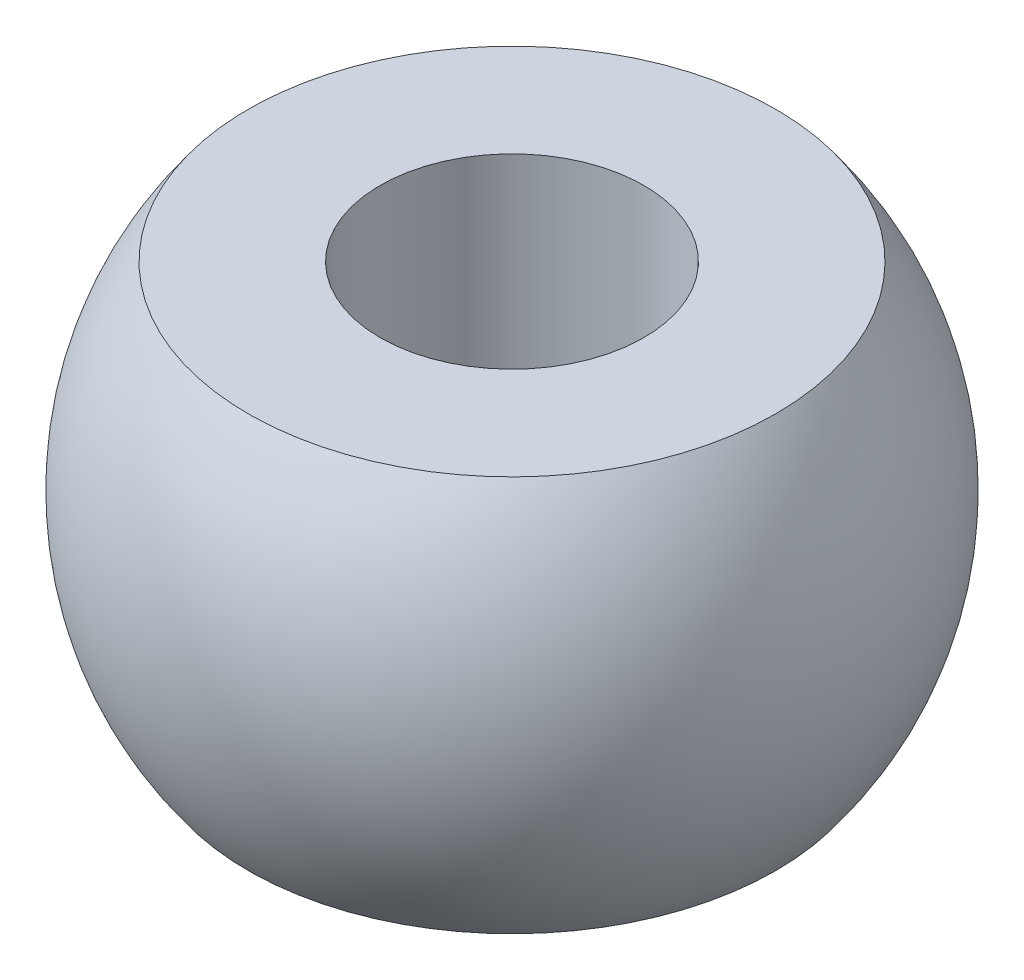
ISO-10303-21;
HEADER;
FILE_DESCRIPTION(('STEP AP214'),'2;1');
FILE_NAME('part.step','',(''),(''),'','','');
FILE_SCHEMA(('AUTOMOTIVE_DESIGN { 1 0 10303 214 1 1 1 1 }'));
ENDSEC;
DATA;
#1=APPLICATION_CONTEXT('core data for automotive mechanical design processes');
#2=APPLICATION_PROTOCOL_DEFINITION('international standard','automotive_design',2000,#1);
#3=PRODUCT_CONTEXT('',#1,'mechanical');
#4=PRODUCT('Part','Part','',(#3));
#5=PRODUCT_RELATED_PRODUCT_CATEGORY('part','',(#4));
#6=PRODUCT_DEFINITION_FORMATION('','',#4);
#7=PRODUCT_DEFINITION_CONTEXT('part definition',#1,'design');
#8=PRODUCT_DEFINITION('design','',#6,#7);
#9=PRODUCT_DEFINITION_SHAPE('','',#8);
#10=(LENGTH_UNIT() NAMED_UNIT(*) SI_UNIT(.MILLI.,.METRE.));
#11=(NAMED_UNIT(*) PLANE_ANGLE_UNIT() SI_UNIT($,.RADIAN.));
#12=(NAMED_UNIT(*) SI_UNIT($,.STERADIAN.) SOLID_ANGLE_UNIT());
#13=UNCERTAINTY_MEASURE_WITH_UNIT(LENGTH_MEASURE(1.E-05),#10,'distance_accuracy_value','');
#14=(GEOMETRIC_REPRESENTATION_CONTEXT(3) GLOBAL_UNCERTAINTY_ASSIGNED_CONTEXT((#13)) GLOBAL_UNIT_ASSIGNED_CONTEXT((#10,
#11,#12)) REPRESENTATION_CONTEXT('',''));
#15=CARTESIAN_POINT('',(0.,0.,0.));
#16=DIRECTION('',(0.,0.,1.));
#17=DIRECTION('',(1.,0.,0.));
#18=AXIS2_PLACEMENT_3D('',#15,#16,#17);
#19=CARTESIAN_POINT('',(0.,43.4669792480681,0.));
#20=DIRECTION('',(0.,1.,0.));
#21=DIRECTION('',(0.,0.,1.));
#22=AXIS2_PLACEMENT_3D('',#19,#20,#21);
#23=CYLINDRICAL_SURFACE('',#22,4.00000000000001);
#24=CARTESIAN_POINT('',(0.,-6.,0.));
#25=DIRECTION('',(0.,1.,0.));
#26=DIRECTION('',(0.,0.,1.));
#27=AXIS2_PLACEMENT_3D('',#24,#25,#26);
#28=CIRCLE('',#27,4.00000000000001);
#29=CARTESIAN_POINT('',(0.,-6.,4.00000000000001));
#30=VERTEX_POINT('',#29);
#31=EDGE_CURVE('E10',#30,#30,#28,.T.);
#32=ORIENTED_EDGE('',*,*,#31,.F.);
#33=EDGE_LOOP('',(#32));
#34=FACE_BOUND('',#33,.T.);
#35=CARTESIAN_POINT('',(0.,6.,0.));
#36=DIRECTION('',(0.,1.,0.));
#37=DIRECTION('',(0.,0.,1.));
#38=AXIS2_PLACEMENT_3D('',#35,#36,#37);
#39=CIRCLE('',#38,4.);
#40=CARTESIAN_POINT('',(0.,6.,4.));
#41=VERTEX_POINT('',#40);
#42=EDGE_CURVE('E42',#41,#41,#39,.T.);
#43=ORIENTED_EDGE('',*,*,#42,.T.);
#44=EDGE_LOOP('',(#43));
#45=FACE_BOUND('',#44,.T.);
#46=ADVANCED_FACE('F28',(#34,#45),#23,.F.);
#47=CARTESIAN_POINT('',(4.00000000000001,-6.,0.));
#48=DIRECTION('',(0.,1.,0.));
#49=DIRECTION('',(0.,0.,1.));
#50=AXIS2_PLACEMENT_3D('',#47,#48,#49);
#51=PLANE('',#50);
#52=CARTESIAN_POINT('',(0.,-6.,0.));
#53=DIRECTION('',(0.,1.,0.));
#54=DIRECTION('',(0.,0.,1.));
#55=AXIS2_PLACEMENT_3D('',#52,#53,#54);
#56=CIRCLE('',#55,8.);
#57=CARTESIAN_POINT('',(8.,-6.,0.));
#58=VERTEX_POINT('',#57);
#59=EDGE_CURVE('E34',#58,#58,#56,.T.);
#60=ORIENTED_EDGE('',*,*,#59,.F.);
#61=EDGE_LOOP('',(#60));
#62=FACE_BOUND('',#61,.T.);
#63=ORIENTED_EDGE('',*,*,#31,.T.);
#64=EDGE_LOOP('',(#63));
#65=FACE_BOUND('',#64,.T.);
#66=ADVANCED_FACE('F57',(#62,#65),#51,.F.);
#67=CARTESIAN_POINT('',(0.,0.,0.));
#68=DIRECTION('',(0.,1.,0.));
#69=DIRECTION('',(1.,0.,0.));
#70=AXIS2_PLACEMENT_3D('',#67,#68,#69);
#71=SPHERICAL_SURFACE('',#70,10.);
#72=CARTESIAN_POINT('',(0.,6.,0.));
#73=DIRECTION('',(0.,1.,0.));
#74=DIRECTION('',(0.,0.,1.));
#75=AXIS2_PLACEMENT_3D('',#72,#73,#74);
#76=CIRCLE('',#75,8.);
#77=CARTESIAN_POINT('',(8.,6.,0.));
#78=VERTEX_POINT('',#77);
#79=EDGE_CURVE('E38',#78,#78,#76,.T.);
#80=CARTESIAN_POINT('',(8.,6.,0.));
#81=CARTESIAN_POINT('',(8.08043892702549,5.89275070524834,0.));
#82=CARTESIAN_POINT('',(8.15871859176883,5.78388210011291,0.));
#83=CARTESIAN_POINT('',(8.31083845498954,5.56308624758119,0.));
#84=CARTESIAN_POINT('',(8.38467865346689,5.45115900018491,0.));
#85=CARTESIAN_POINT('',(8.52779864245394,5.22442584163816,0.));
#86=CARTESIAN_POINT('',(8.59707843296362,5.10961993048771,0.));
#87=CARTESIAN_POINT('',(8.73096596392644,4.87731540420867,0.));
#88=CARTESIAN_POINT('',(8.79557370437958,4.75981678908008,0.));
#89=CARTESIAN_POINT('',(8.92001253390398,4.5223168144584,0.));
#90=CARTESIAN_POINT('',(8.97984362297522,4.40231545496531,0.));
#91=CARTESIAN_POINT('',(9.09463241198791,4.16000409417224,0.));
#92=CARTESIAN_POINT('',(9.14959011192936,4.03769409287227,0.));
#93=CARTESIAN_POINT('',(9.25454322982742,3.79096325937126,0.));
#94=CARTESIAN_POINT('',(9.30453864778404,3.66654242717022,0.));
#95=CARTESIAN_POINT('',(9.39948634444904,3.41579116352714,0.));
#96=CARTESIAN_POINT('',(9.44443862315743,3.28946073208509,0.));
#97=CARTESIAN_POINT('',(9.52922733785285,3.03509458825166,0.));
#98=CARTESIAN_POINT('',(9.56906377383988,2.90705887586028,0.));
#99=CARTESIAN_POINT('',(9.64355637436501,2.64948924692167,0.));
#100=CARTESIAN_POINT('',(9.67821253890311,2.51995533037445,0.));
#101=CARTESIAN_POINT('',(9.74228854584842,2.2595987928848,0.));
#102=CARTESIAN_POINT('',(9.77170838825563,2.12877617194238,0.));
#103=CARTESIAN_POINT('',(9.82526416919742,1.86605380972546,0.));
#104=CARTESIAN_POINT('',(9.84940010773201,1.73415406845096,0.));
#105=CARTESIAN_POINT('',(9.89234904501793,1.46949079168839,0.));
#106=CARTESIAN_POINT('',(9.91116204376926,1.33672725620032,0.));
#107=CARTESIAN_POINT('',(9.94343467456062,1.07055111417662,0.));
#108=CARTESIAN_POINT('',(9.95689430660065,0.937138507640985,0.));
#109=CARTESIAN_POINT('',(9.97843843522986,0.669879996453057,0.));
#110=CARTESIAN_POINT('',(9.98652293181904,0.536034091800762,0.));
#111=CARTESIAN_POINT('',(9.99730371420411,0.268125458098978,0.));
#112=CARTESIAN_POINT('',(10.,0.134062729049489,0.));
#113=CARTESIAN_POINT('',(10.,-0.134062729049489,0.));
#114=CARTESIAN_POINT('',(9.99730371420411,-0.268125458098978,0.));
#115=CARTESIAN_POINT('',(9.98652293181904,-0.536034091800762,0.));
#116=CARTESIAN_POINT('',(9.97843843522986,-0.669879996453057,0.));
#117=CARTESIAN_POINT('',(9.95689430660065,-0.937138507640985,0.));
#118=CARTESIAN_POINT('',(9.94343467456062,-1.07055111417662,0.));
#119=CARTESIAN_POINT('',(9.91116204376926,-1.33672725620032,0.));
#120=CARTESIAN_POINT('',(9.89234904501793,-1.46949079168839,0.));
#121=CARTESIAN_POINT('',(9.84940010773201,-1.73415406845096,0.));
#122=CARTESIAN_POINT('',(9.82526416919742,-1.86605380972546,0.));
#123=CARTESIAN_POINT('',(9.77170838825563,-2.12877617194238,0.));
#124=CARTESIAN_POINT('',(9.74228854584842,-2.2595987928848,0.));
#125=CARTESIAN_POINT('',(9.67821253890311,-2.51995533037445,0.));
#126=CARTESIAN_POINT('',(9.64355637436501,-2.64948924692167,0.));
#127=CARTESIAN_POINT('',(9.56906377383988,-2.90705887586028,0.));
#128=CARTESIAN_POINT('',(9.52922733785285,-3.03509458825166,0.));
#129=CARTESIAN_POINT('',(9.44443862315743,-3.28946073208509,0.));
#130=CARTESIAN_POINT('',(9.39948634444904,-3.41579116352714,0.));
#131=CARTESIAN_POINT('',(9.30453864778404,-3.66654242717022,0.));
#132=CARTESIAN_POINT('',(9.25454322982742,-3.79096325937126,0.));
#133=CARTESIAN_POINT('',(9.14959011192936,-4.03769409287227,0.));
#134=CARTESIAN_POINT('',(9.09463241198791,-4.16000409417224,0.));
#135=CARTESIAN_POINT('',(8.97984362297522,-4.40231545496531,0.));
#136=CARTESIAN_POINT('',(8.92001253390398,-4.5223168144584,0.));
#137=CARTESIAN_POINT('',(8.79557370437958,-4.75981678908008,0.));
#138=CARTESIAN_POINT('',(8.73096596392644,-4.87731540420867,0.));
#139=CARTESIAN_POINT('',(8.59707843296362,-5.10961993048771,0.));
#140=CARTESIAN_POINT('',(8.52779864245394,-5.22442584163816,0.));
#141=CARTESIAN_POINT('',(8.38467865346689,-5.45115900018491,0.));
#142=CARTESIAN_POINT('',(8.31083845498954,-5.56308624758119,0.));
#143=CARTESIAN_POINT('',(8.15871859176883,-5.78388210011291,0.));
#144=CARTESIAN_POINT('',(8.08043892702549,-5.89275070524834,0.));
#145=CARTESIAN_POINT('',(8.,-6.,0.));
#146=B_SPLINE_CURVE_WITH_KNOTS('',3,(#80,#81,#82,#83,#84,#85,#86,#87,#88,#89,#90,#91,#92,#93,
#94,#95,#96,#97,#98,#99,#100,#101,#102,#103,#104,#105,#106,#107,#108,#109,#110,#111,#112,#113,
#114,#115,#116,#117,#118,#119,#120,#121,#122,#123,#124,#125,#126,#127,#128,#129,#130,#131,#132,
#133,#134,#135,#136,#137,#138,#139,#140,#141,#142,#143,#144,#145),.UNSPECIFIED.,.F.,.F.,(4,2,2,
2,2,2,2,2,2,2,2,2,2,2,2,2,2,2,2,2,2,2,2,2,2,2,2,2,2,2,2,2,4),(0.,0.402161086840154,
0.804322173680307,1.20648326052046,1.60864434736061,2.01080543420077,2.41296652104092,
2.81512760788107,3.21728869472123,3.61944978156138,4.02161086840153,4.42377195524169,
4.82593304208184,5.228094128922,5.63025521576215,6.0324163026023,6.43457738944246,
6.83673847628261,7.23889956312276,7.64106064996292,8.04322173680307,8.44538282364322,
8.84754391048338,9.24970499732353,9.65186608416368,10.0540271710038,10.456188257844,
10.8583493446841,11.2605104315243,11.6626715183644,12.0648326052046,12.4669936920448,
12.8691547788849),.UNSPECIFIED.);
#147=EDGE_CURVE('BSEAM52',#78,#58,#146,.T.);
#148=ORIENTED_EDGE('',*,*,#79,.F.);
#149=ORIENTED_EDGE('',*,*,#59,.T.);
#150=ORIENTED_EDGE('',*,*,#147,.T.);
#151=ORIENTED_EDGE('',*,*,#147,.F.);
#152=EDGE_LOOP('',(#148,#150,#149,#151));
#153=FACE_BOUND('',#152,.T.);
#154=ADVANCED_FACE('F52',(#153),#71,.T.);
#155=CARTESIAN_POINT('',(4.,6.,0.));
#156=DIRECTION('',(0.,-1.,0.));
#157=DIRECTION('',(0.,0.,-1.));
#158=AXIS2_PLACEMENT_3D('',#155,#156,#157);
#159=PLANE('',#158);
#160=ORIENTED_EDGE('',*,*,#42,.F.);
#161=EDGE_LOOP('',(#160));
#162=FACE_BOUND('',#161,.T.);
#163=ORIENTED_EDGE('',*,*,#79,.T.);
#164=EDGE_LOOP('',(#163));
#165=FACE_BOUND('',#164,.T.);
#166=ADVANCED_FACE('F49',(#162,#165),#159,.F.);
#167=CLOSED_SHELL('',(#46,#66,#154,#166));
#168=MANIFOLD_SOLID_BREP('B2',#167);
#169=ADVANCED_BREP_SHAPE_REPRESENTATION('',(#18,#168),#14);
#170=SHAPE_DEFINITION_REPRESENTATION(#9,#169);
ENDSEC;
END-ISO-10303-21;
